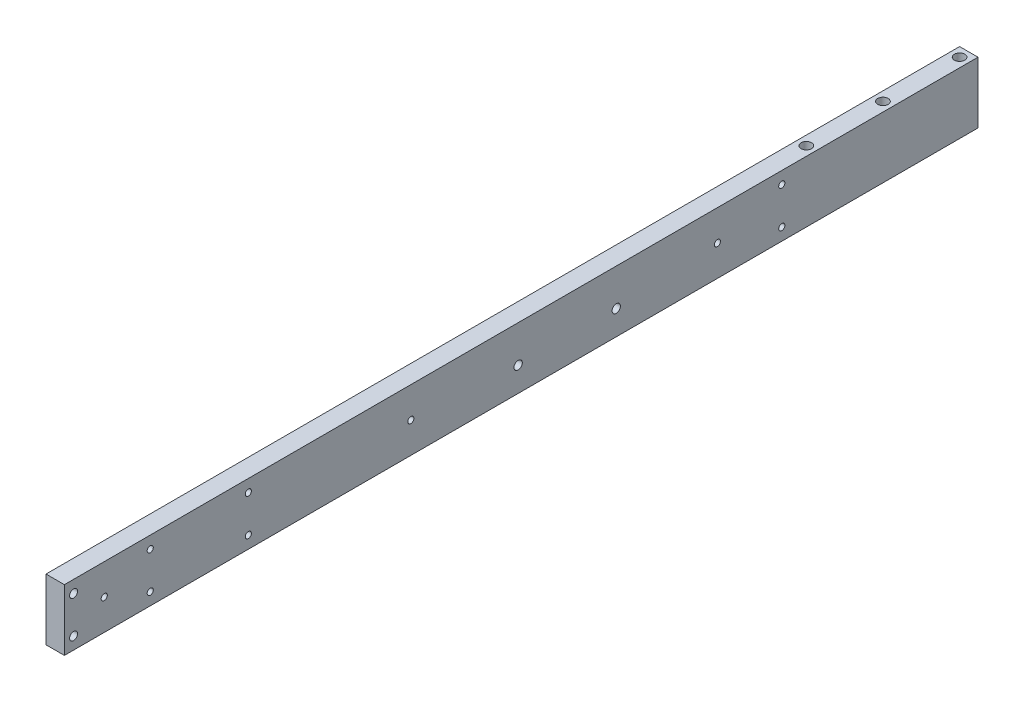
from build123d import *

# Parameters (mm, degrees)
ESQUISSE1_W                            = 15
ESQUISSE1_H                            = 50
EXTRUSION1_DEPTH                       = 745
D_GAGEMENT_M81_D                       = 8.5
CHAMBRAGE_POUR_AXES_6_5_MM_D           = 6.5
CHAMBRAGE_POUR_AXES_6_5_MM_CBORE_D     = 12
CHAMBRAGE_POUR_AXES_6_5_MM_CBORE_DEPTH = 6
TROU_TARAUD_M61_D                      = 5
TROU_TARAUD_M62_D                      = 5
TROU_TARAUD_M81_D                      = 6.8


with BuildPart() as part:
    # Esquisse1 → Extrusion1 (new body)
    with BuildSketch(Plane.XY):
        with Locations((7.5, 25)):
            Rectangle(ESQUISSE1_W, ESQUISSE1_H)
    extrude(amount=-EXTRUSION1_DEPTH)

    # D_gagement M81 (through all)
    with Locations(Plane(origin=(0, 50, 0), x_dir=(-1, 0, 0), z_dir=(0, 1, 0))):
        with Locations((-7.5, -675), (-7.5, -737.5), (-7.5, -612.5)):
            Hole(D_GAGEMENT_M81_D / 2)

    # Chambrage pour axes 6.5 mm (through all)
    with Locations(Plane.ZY):
        with Locations((-7.5, 10), (-7.5, 40)):
            CounterBoreHole(CHAMBRAGE_POUR_AXES_6_5_MM_D / 2, CHAMBRAGE_POUR_AXES_6_5_MM_CBORE_D / 2, CHAMBRAGE_POUR_AXES_6_5_MM_CBORE_DEPTH)

    # Trou taraud_ M61 (through all)
    with Locations(Plane(origin=(15, 0, 0), x_dir=(0, 0, -1), z_dir=(1, 0, 0))):
        with Locations((585, 40), (585, 10), (70, 10), (70, 40), (150, 40), (150, 10)):
            Hole(TROU_TARAUD_M61_D / 2)

    # Trou taraud_ M62 (through all)
    with Locations(Plane.ZY):
        with Locations((-532.5, 25), (-282.5, 25), (-32.5, 25)):
            Hole(TROU_TARAUD_M62_D / 2)

    # Trou taraud_ M81 (through all)
    with Locations(Plane(origin=(15, 0, 0), x_dir=(0, 0, -1), z_dir=(1, 0, 0))):
        with Locations((450, 20), (370, 20)):
            Hole(TROU_TARAUD_M81_D / 2)


solid = part.part
